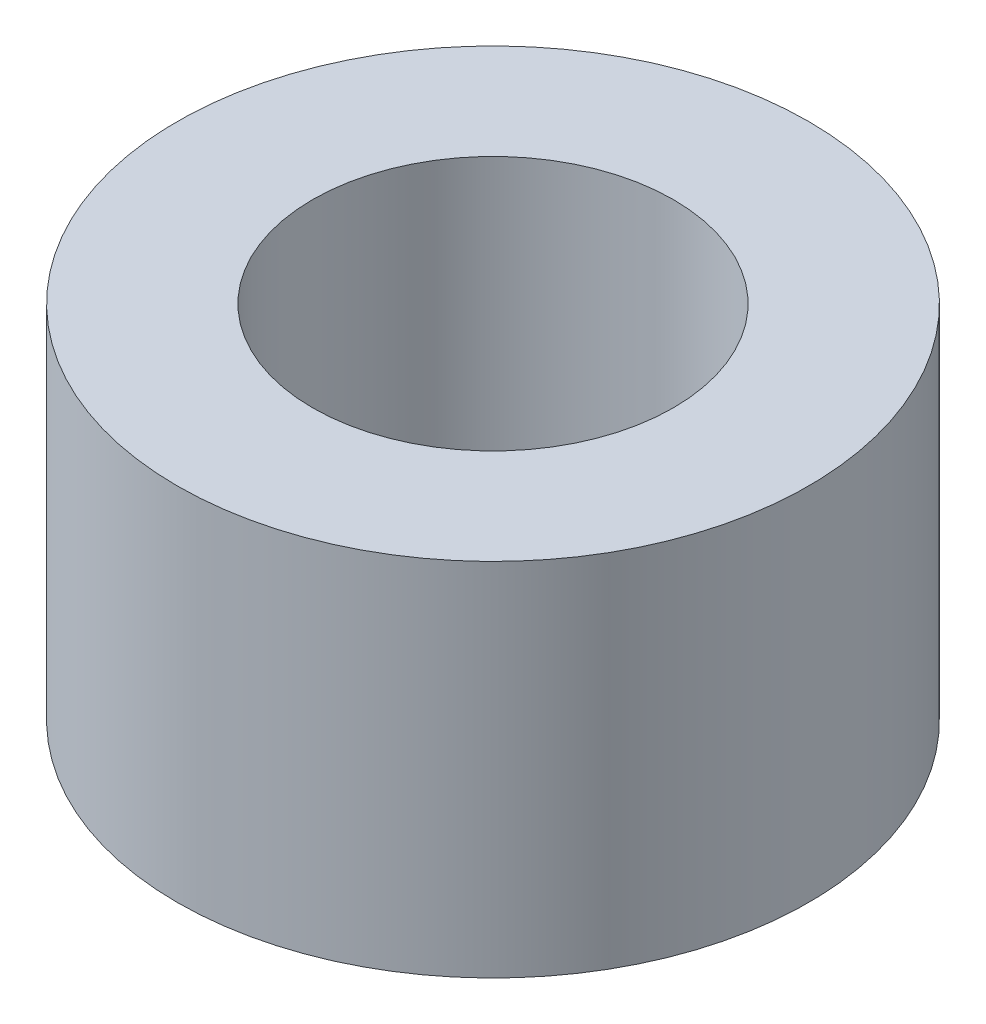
ISO-10303-21;
HEADER;
FILE_DESCRIPTION(('STEP AP214'),'2;1');
FILE_NAME('part.step','',(''),(''),'','','');
FILE_SCHEMA(('AUTOMOTIVE_DESIGN { 1 0 10303 214 1 1 1 1 }'));
ENDSEC;
DATA;
#1=APPLICATION_CONTEXT('core data for automotive mechanical design processes');
#2=APPLICATION_PROTOCOL_DEFINITION('international standard','automotive_design',2000,#1);
#3=PRODUCT_CONTEXT('',#1,'mechanical');
#4=PRODUCT('Part','Part','',(#3));
#5=PRODUCT_RELATED_PRODUCT_CATEGORY('part','',(#4));
#6=PRODUCT_DEFINITION_FORMATION('','',#4);
#7=PRODUCT_DEFINITION_CONTEXT('part definition',#1,'design');
#8=PRODUCT_DEFINITION('design','',#6,#7);
#9=PRODUCT_DEFINITION_SHAPE('','',#8);
#10=(LENGTH_UNIT() NAMED_UNIT(*) SI_UNIT(.MILLI.,.METRE.));
#11=(NAMED_UNIT(*) PLANE_ANGLE_UNIT() SI_UNIT($,.RADIAN.));
#12=(NAMED_UNIT(*) SI_UNIT($,.STERADIAN.) SOLID_ANGLE_UNIT());
#13=UNCERTAINTY_MEASURE_WITH_UNIT(LENGTH_MEASURE(1.E-05),#10,'distance_accuracy_value','');
#14=(GEOMETRIC_REPRESENTATION_CONTEXT(3) GLOBAL_UNCERTAINTY_ASSIGNED_CONTEXT((#13)) GLOBAL_UNIT_ASSIGNED_CONTEXT((#10,
#11,#12)) REPRESENTATION_CONTEXT('',''));
#15=CARTESIAN_POINT('',(0.,0.,0.));
#16=DIRECTION('',(0.,0.,1.));
#17=DIRECTION('',(1.,0.,0.));
#18=AXIS2_PLACEMENT_3D('',#15,#16,#17);
#19=CARTESIAN_POINT('',(-9.66506098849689,4.,-11.5149752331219));
#20=DIRECTION('',(0.,1.,0.));
#21=DIRECTION('',(0.,0.,1.));
#22=AXIS2_PLACEMENT_3D('',#19,#20,#21);
#23=PLANE('',#22);
#24=CARTESIAN_POINT('',(-9.66506098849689,4.,-11.5149752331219));
#25=DIRECTION('',(0.,1.,0.));
#26=DIRECTION('',(0.,0.,1.));
#27=AXIS2_PLACEMENT_3D('',#24,#25,#26);
#28=CIRCLE('',#27,3.5);
#29=CARTESIAN_POINT('',(-9.66506098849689,4.,-8.01497523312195));
#30=VERTEX_POINT('',#29);
#31=EDGE_CURVE('E10',#30,#30,#28,.T.);
#32=ORIENTED_EDGE('',*,*,#31,.T.);
#33=EDGE_LOOP('',(#32));
#34=FACE_BOUND('',#33,.T.);
#35=CARTESIAN_POINT('',(-9.66506098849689,4.,-11.5149752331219));
#36=DIRECTION('',(0.,1.,0.));
#37=DIRECTION('',(0.,0.,1.));
#38=AXIS2_PLACEMENT_3D('',#35,#36,#37);
#39=CIRCLE('',#38,2.);
#40=CARTESIAN_POINT('',(-9.66506098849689,4.,-9.51497523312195));
#41=VERTEX_POINT('',#40);
#42=EDGE_CURVE('E44',#41,#41,#39,.T.);
#43=ORIENTED_EDGE('',*,*,#42,.F.);
#44=EDGE_LOOP('',(#43));
#45=FACE_BOUND('',#44,.T.);
#46=ADVANCED_FACE('F33',(#34,#45),#23,.T.);
#47=CARTESIAN_POINT('',(-9.66506098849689,0.,-11.5149752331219));
#48=DIRECTION('',(0.,1.,0.));
#49=DIRECTION('',(0.,0.,1.));
#50=AXIS2_PLACEMENT_3D('',#47,#48,#49);
#51=PLANE('',#50);
#52=CARTESIAN_POINT('',(-9.66506098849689,0.,-11.5149752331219));
#53=DIRECTION('',(0.,1.,0.));
#54=DIRECTION('',(0.,0.,1.));
#55=AXIS2_PLACEMENT_3D('',#52,#53,#54);
#56=CIRCLE('',#55,3.5);
#57=CARTESIAN_POINT('',(-9.66506098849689,0.,-8.01497523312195));
#58=VERTEX_POINT('',#57);
#59=EDGE_CURVE('E37',#58,#58,#56,.T.);
#60=ORIENTED_EDGE('',*,*,#59,.F.);
#61=EDGE_LOOP('',(#60));
#62=FACE_BOUND('',#61,.T.);
#63=CARTESIAN_POINT('',(-9.66506098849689,0.,-11.5149752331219));
#64=DIRECTION('',(0.,1.,0.));
#65=DIRECTION('',(0.,0.,1.));
#66=AXIS2_PLACEMENT_3D('',#63,#64,#65);
#67=CIRCLE('',#66,2.);
#68=CARTESIAN_POINT('',(-9.66506098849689,0.,-9.51497523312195));
#69=VERTEX_POINT('',#68);
#70=EDGE_CURVE('E46',#69,#69,#67,.T.);
#71=ORIENTED_EDGE('',*,*,#70,.T.);
#72=EDGE_LOOP('',(#71));
#73=FACE_BOUND('',#72,.T.);
#74=ADVANCED_FACE('F56',(#62,#73),#51,.F.);
#75=CARTESIAN_POINT('',(-9.66506098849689,4.,-11.5149752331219));
#76=DIRECTION('',(0.,-1.,0.));
#77=DIRECTION('',(0.,0.,-1.));
#78=AXIS2_PLACEMENT_3D('',#75,#76,#77);
#79=CYLINDRICAL_SURFACE('',#78,3.5);
#80=ORIENTED_EDGE('',*,*,#31,.F.);
#81=EDGE_LOOP('',(#80));
#82=FACE_BOUND('',#81,.T.);
#83=ORIENTED_EDGE('',*,*,#59,.T.);
#84=EDGE_LOOP('',(#83));
#85=FACE_BOUND('',#84,.T.);
#86=ADVANCED_FACE('F35',(#82,#85),#79,.T.);
#87=CARTESIAN_POINT('',(-9.66506098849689,4.,-11.5149752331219));
#88=DIRECTION('',(0.,-1.,0.));
#89=DIRECTION('',(0.,0.,-1.));
#90=AXIS2_PLACEMENT_3D('',#87,#88,#89);
#91=CYLINDRICAL_SURFACE('',#90,2.);
#92=ORIENTED_EDGE('',*,*,#42,.T.);
#93=EDGE_LOOP('',(#92));
#94=FACE_BOUND('',#93,.T.);
#95=ORIENTED_EDGE('',*,*,#70,.F.);
#96=EDGE_LOOP('',(#95));
#97=FACE_BOUND('',#96,.T.);
#98=ADVANCED_FACE('F52',(#94,#97),#91,.F.);
#99=CLOSED_SHELL('',(#46,#74,#86,#98));
#100=MANIFOLD_SOLID_BREP('B2',#99);
#101=ADVANCED_BREP_SHAPE_REPRESENTATION('',(#18,#100),#14);
#102=SHAPE_DEFINITION_REPRESENTATION(#9,#101);
ENDSEC;
END-ISO-10303-21;
